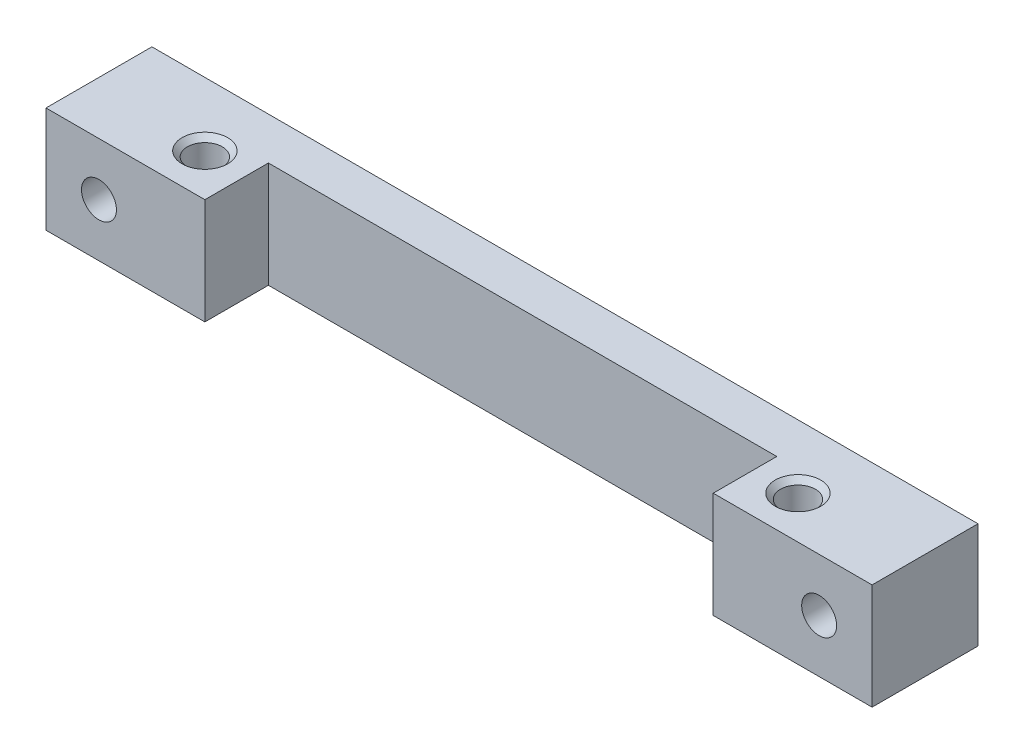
from build123d import *

# Parameters (mm, degrees)
EXTRUDE_1_DEPTH   = 10
HOLE_WIZARD_M41_D = 3.3
HOLE_WIZARD_M42_D = 3.3
CHAMFER_1_SIZE    = 0.5


with BuildPart() as part:
    # Sketch 1 → Extrude 1 (new body)
    with BuildSketch(Plane(origin=(0, 0, 0), x_dir=(1, 0, 0), z_dir=(0, 1, 0))):
        Polygon((39, 0), (-39, 0), (-39, -10), (-24, -10), (-24, -4), (24, -4), (24, -10), (39, -10), align=None)
    extrude(amount=EXTRUDE_1_DEPTH)

    # Hole Wizard M41 (through all)
    with Locations(Plane(origin=(0, 10, 0), x_dir=(1, 0, 0), z_dir=(0, 1, 0))):
        with Locations((-28, -6), (28, -6)):
            Hole(HOLE_WIZARD_M41_D / 2)

    # Hole Wizard M42 (through all)
    with Locations(Plane(origin=(0, 0, 0), x_dir=(-1, 0, 0), z_dir=(0, 0, -1))):
        with Locations((-34, 5), (34, 5)):
            Hole(HOLE_WIZARD_M42_D / 2)

    # Chamfer 1
    chamfer_1_edges = [part.edges().sort_by_distance(p)[0] for p in [
        (29.65, 10, 6),
        (-26.35, 10, 6),
        (-35.65, 5, 0),
        (32.35, 5, 0),
    ]]
    chamfer(chamfer_1_edges, length=CHAMFER_1_SIZE)


solid = part.part
